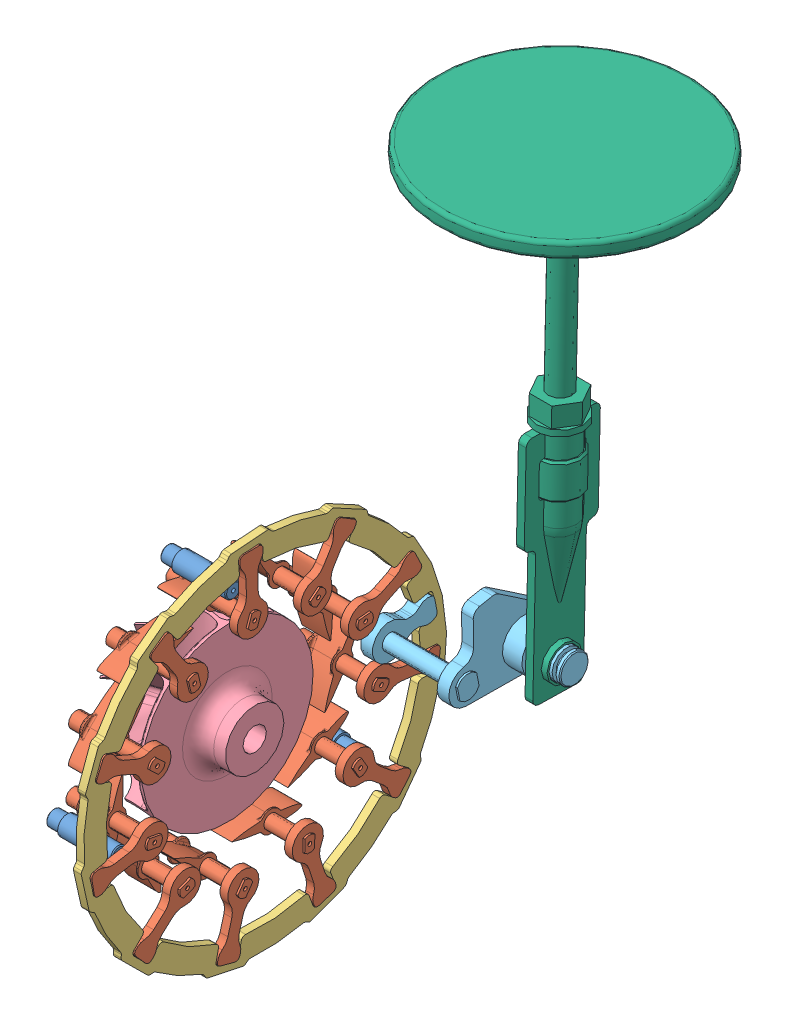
SolidWorks assembly Turbo_Geometrie_Variable.SLDASM, configuration Défaut (file format 3100). Lengths in mm.
Overall size (92.55 179.91 137.02).
35 component instances, 19 part files, 75 mates.
Components (placement in the parent):
- Support_aubes-1: Support_aubes.SLDASM [Défaut] x (-1 0 0) z (0 -0.818224 0.5749) size (38 103.8 103.8)
  - Flasque_2_v2-1: Flasque_2_v2.SLDPRT [Défaut] at origin size (19.5 103.8 103.8)
  - Entretoise-1: Entretoise.SLDPRT [Défaut] at (-2 34.988 -0.9162) size (16.8 5 5)
  - Entretoise-2: Entretoise.SLDPRT [Défaut] at (-2 -22.2199 27.0421) size (16.8 5 5)
  - Entretoise-3: Entretoise.SLDPRT [Défaut] at (-2 -23.6047 -25.8422) size (16.8 5 5)
  - Flasque_1-1: Flasque_1.SLDPRT [Défaut] at (11.3 0 0) x (-1 0 0) z (0 0 -1) size (11.2 83.5 83.5)
- Aube-1: Aube.SLDPRT [Défaut] at (-4 -1.2175 -29.4749) x (0 0.891806 -0.452417) z (-1 0 0) size (18 19.29 20.8)
- Bague_commande-1: Bague_commande.SLDPRT [Défaut] at (5.2 0 0) x (0 -0.976146 -0.217114) z (-1 0 0) size (93.91 94 2)
- Aube-2: Aube.SLDPRT [Défaut] at (-4 -16.9595 -24.1376) x (0 0.50564 -0.862744) z (-1 0 0) size (18 19.29 20.8)
- Aube-3: Aube.SLDPRT [Défaut] at (-4 -27.317 -11.1368) x (0 -0.041063 -0.999157) z (-1 0 0) size (18 19.29 20.8)
- Aube-4: Aube.SLDPRT [Défaut] at (-4 -29.0016 5.3998) x (0 -0.574729 -0.818343) z (-1 0 0) size (18 19.29 20.8)
- Aube-5: Aube.SLDPRT [Défaut] at (-4 -21.4783 20.2221) x (0 -0.925923 -0.377712) z (-1 0 0) size (18 19.29 20.8)
- Aube-6: Aube.SLDPRT [Défaut] at (-4 -7.1359 28.6239) x (0 -0.983143 0.18284) z (-1 0 0) size (18 19.29 20.8)
- Aube-7: Aube.SLDPRT [Défaut] at (-4 9.4722 27.9379) x (0 -0.728221 0.685342) z (-1 0 0) size (18 19.29 20.8)
- Aube-8: Aube.SLDPRT [Défaut] at (-4 26.3055 -13.3518) x (0 0.782003 0.623275) z (-1 0 0) size (18 19.29 20.8)
- Aube-9: Aube.SLDPRT [Défaut] at (-4 23.0729 18.3818) x (0 -0.242095 0.970253) z (-1 0 0) size (18 19.29 20.8)
- Aube-10: Aube.SLDPRT [Défaut] at (-4 29.3481 2.9896) x (0 0.320895 0.947115) z (-1 0 0) size (18 19.29 20.8)
- Aube-11: Aube.SLDPRT [Défaut] at (-4 14.9111 -25.4541) x (0 0.99483 0.10155) z (-1 0 0) size (18 19.29 20.8)
- Turbine-1: Turbine.SLDPRT [Défaut] at (-4 0 0) x (0 0.99715 0.07544) z (0 -0.07544 0.99715) size (44.34 30 44.41)
- Corps-1: Corps.SLDPRT [Défaut] at (-1 0 0) x (-1 0 0) z (0 -0.802817 -0.596225) size (64.1 115 115) (hidden)
- Axe_commande-1: Axe_commande.SLDPRT [Défaut] at (6 7.323 -31.6642) x (0 0.98172 0.190333) z (-1 0 0) size (22.5 27 35.6)
- Butee-1: Butee.SLDPRT [Défaut] at (24 34.6988 -21.5637) x (-1 0 0) z (0 0.802817 0.596225) size (8.08 7 19.5) (hidden)
- Volute_turbine-1: Volute_turbine.SLDPRT [Défaut] at (16.55 0 0) x (1 0 0) z (0 -0.802817 -0.596225) size (116 165.46 146.29) (hidden)
- Platine_poumon-1: Platine_poumon.SLDPRT [Défaut] at (33.55 84.8988 -48.9101) x (0 0 1) z (-1 0 0) size (101.36 60 51) (hidden)
- Prot_therm_poumon-1: Prot_therm_poumon.SLDPRT [Défaut] at (33.55 88.8988 -48.9101) size (80 55 80) (hidden)
- Corps_poumon-1: Corps_poumon.SLDPRT [Défaut] at (33.55 81.8988 -48.9101) size (76 86.5 76) (hidden)
- Piston_Poumon-1: Piston_Poumon.SLDPRT [Défaut] at (33.55 121.1494 -48.9101) x (0 -0.022703 -0.999742) z (1 0 0) size (64 120.5 64)
- Axe-1: Axe.SLDPRT [Défaut] at (-33 0 0) x (-1 0 0) z (0 -0.818224 0.5749) size (122 12 12) (hidden)
- Compresseur-1: Compresseur.SLDPRT [Défaut] at (58.9 0 0) x (0 -1 0) z (0 0 1) size (47.93 29.5 48.01) (hidden)
- Vis-Rondelle_M6-12-1: Vis-Rondelle_M6-12.SLDPRT [Défaut] at (24.25 57.3988 -3.4101) x (0 -1 0) z (0 0 1) size (14 17 14) (hidden)
- Vis-Rondelle_M6-12-2: Vis-Rondelle_M6-12.SLDPRT [Défaut] at (24.25 63.8988 -33.9101) x (0 -1 0) z (0 0 1) size (14 17 14) (hidden)
- Vis-Rondelle_M6-12-3: Vis-Rondelle_M6-12.SLDPRT [Défaut] at (24.25 63.8988 -63.9101) x (0 -1 0) z (0 0 1) size (14 17 14) (hidden)
- Ecrou_M6-1: Ecrou_M6.SLDPRT [Défaut] at (-29.5 0 0) x (0 1 0) z (0 0 1) size (11.55 5 10) (hidden)
- Ecrou-Rondelle_M6-1: Ecrou-Rondelle_M6.SLDPRT [Défaut] at (33.55 81.1988 -30.9101) x (-0.837169 0 -0.546944) z (-0.546944 0 0.837169) size (14 6.2 14) (hidden)
- Ecrou-Rondelle_M6-2: Ecrou-Rondelle_M6.SLDPRT [Défaut] at (33.55 81.1988 -66.9101) x (-0.837169 0 -0.546944) z (-0.546944 0 0.837169) size (14 6.2 14) (hidden)
Mates (geometry in assembly coordinates):
- Coaxiale1: concentric aligned: cylinder of Support_aubes-1/Flasque_2_v2-1; unknown of Aube-1
- Coïncidente1: coincident anti-aligned: plane of Support_aubes-1/Flasque_2_v2-1 through (-4 -24.0308 -34.2018) normal (-1 0 0); unknown of Aube-1
- Coaxiale2: concentric anti-aligned: unknown of Support_aubes-1/Flasque_2_v2-1; unknown of Bague_commande-1
- Coïncidente2: coincident anti-aligned: unknown of Support_aubes-1/Flasque_2_v2-1; unknown of Bague_commande-1
- Tangent1: tangent anti-aligned: unknown of Aube-1; unknown of Bague_commande-1
- Coaxiale3: concentric aligned: unknown of Support_aubes-1/Flasque_2_v2-1; unknown of Aube-2
- Coïncidente3: coincident anti-aligned: unknown of Support_aubes-1/Flasque_2_v2-1; unknown of Aube-2
- Tangent2: tangent anti-aligned: unknown of Bague_commande-1; unknown of Aube-2
- Coaxiale5: concentric aligned: unknown of Support_aubes-1/Flasque_2_v2-1; unknown of Aube-3
- Coïncidente4: coincident anti-aligned: unknown of Support_aubes-1/Flasque_2_v2-1; unknown of Aube-3
- Tangent3: tangent anti-aligned: unknown of Bague_commande-1; unknown of Aube-3
- Coaxiale6: concentric aligned: unknown of Support_aubes-1/Flasque_2_v2-1; unknown of Aube-4
- Tangent4: tangent anti-aligned: unknown of Bague_commande-1; unknown of Aube-4
- Coïncidente6: coincident anti-aligned: unknown of Support_aubes-1/Flasque_2_v2-1; unknown of Aube-4
- Coaxiale7: concentric aligned: unknown of Support_aubes-1/Flasque_2_v2-1; unknown of Aube-5
- Coïncidente7: coincident anti-aligned: unknown of Support_aubes-1/Flasque_2_v2-1; unknown of Aube-5
- Tangent5: tangent anti-aligned: unknown of Bague_commande-1; unknown of Aube-5
- Coaxiale8: concentric aligned: unknown of Support_aubes-1/Flasque_2_v2-1; unknown of Aube-6
- Coïncidente8: coincident anti-aligned: unknown of Support_aubes-1/Flasque_2_v2-1; unknown of Aube-6
- Tangent6: tangent anti-aligned: unknown of Bague_commande-1; unknown of Aube-6
- Coaxiale9: concentric aligned: unknown of Support_aubes-1/Flasque_2_v2-1; unknown of Aube-7
- Coïncidente9: coincident anti-aligned: unknown of Support_aubes-1/Flasque_2_v2-1; unknown of Aube-7
- Tangent7: tangent anti-aligned: unknown of Bague_commande-1; unknown of Aube-7
- Coaxiale10: concentric aligned: unknown of Support_aubes-1/Flasque_2_v2-1; unknown of Aube-9
- Coïncidente10: coincident anti-aligned: unknown of Support_aubes-1/Flasque_2_v2-1; unknown of Aube-9
- Tangent8: tangent anti-aligned: unknown of Bague_commande-1; unknown of Aube-9
- Coaxiale11: concentric aligned: unknown of Support_aubes-1/Flasque_2_v2-1; unknown of Aube-10
- Coïncidente11: coincident anti-aligned: unknown of Support_aubes-1/Flasque_2_v2-1; unknown of Aube-10
- Tangent9: tangent anti-aligned: unknown of Bague_commande-1; unknown of Aube-10
- Coaxiale12: concentric aligned: unknown of Support_aubes-1/Flasque_2_v2-1; unknown of Aube-8
- Coïncidente13: coincident anti-aligned: unknown of Support_aubes-1/Flasque_2_v2-1; unknown of Aube-8
- Tangent11: tangent anti-aligned: unknown of Bague_commande-1; unknown of Aube-8
- Coaxiale13: concentric aligned: unknown of Support_aubes-1/Flasque_2_v2-1; unknown of Aube-11
- Coïncidente14: coincident anti-aligned: unknown of Support_aubes-1/Flasque_2_v2-1; unknown of Aube-11
- Tangent12: tangent anti-aligned: unknown of Bague_commande-1; unknown of Aube-11
- Coaxiale15: concentric aligned: unknown of Support_aubes-1/Flasque_2_v2-1; unknown of Corps-1
- Coaxiale16: concentric aligned: unknown of Support_aubes-1/Flasque_2_v2-1; unknown of Corps-1
- Coïncidente16: coincident anti-aligned: unknown of Support_aubes-1/Flasque_2_v2-1; unknown of Corps-1
- Coaxiale17: concentric anti-aligned: unknown of Corps-1; unknown of Axe_commande-1
- Coïncidente17: coincident anti-aligned: unknown of Corps-1; unknown of Axe_commande-1
- Tangent13: tangent anti-aligned: unknown of Bague_commande-1; unknown of Axe_commande-1
- Coaxiale18: concentric aligned: unknown of Corps-1; unknown of Butee-1
- Coïncidente18: coincident anti-aligned: unknown of Corps-1; unknown of Butee-1
- Coaxiale19: concentric anti-aligned: unknown of Corps-1; unknown of Volute_turbine-1
- Coïncidente19: coincident anti-aligned: unknown of Support_aubes-1/Flasque_2_v2-1; unknown of Volute_turbine-1
- Coïncidente20: coincident anti-aligned: unknown of Volute_turbine-1; unknown of Platine_poumon-1
- Coaxiale20: concentric anti-aligned: unknown of Volute_turbine-1; unknown of Platine_poumon-1
- Coaxiale21: concentric anti-aligned: unknown of Volute_turbine-1; unknown of Platine_poumon-1
- Coïncidente21: coincident anti-aligned: unknown of Platine_poumon-1; unknown of Prot_therm_poumon-1
- Coaxiale22: concentric aligned: unknown of Platine_poumon-1; unknown of Prot_therm_poumon-1
- Coaxiale23: concentric aligned: unknown of Platine_poumon-1; unknown of Prot_therm_poumon-1
- Coïncidente22: coincident anti-aligned: unknown of Prot_therm_poumon-1; unknown of Corps_poumon-1
- Coaxiale24: concentric anti-aligned: circle of Platine_poumon-1 centre (33.55 88.8988 -48.9101) axis (0 1 0); unknown of Corps_poumon-1
- Coaxiale25: concentric anti-aligned: unknown of Platine_poumon-1; unknown of Corps_poumon-1
- Coaxiale26: concentric anti-aligned: unknown of Axe_commande-1; unknown of Piston_Poumon-1
- Tangent14: tangent aligned: unknown of Corps_poumon-1; sphere of Piston_Poumon-1
- Perpendiculaire1: perpendicular: unknown of Corps-1; unknown of Volute_turbine-1
- Coaxiale27: concentric anti-aligned: unknown of Turbine-1; unknown of Axe-1
- Coïncidente23: coincident anti-aligned: unknown of Turbine-1; unknown of Axe-1
- Coïncidente24: coincident anti-aligned: unknown of Corps-1; unknown of Axe-1
- Coaxiale28: concentric aligned: unknown of Corps-1; unknown of Axe-1
- Coaxiale29: concentric anti-aligned: unknown of Axe-1; unknown of Compresseur-1
- Coïncidente25: coincident anti-aligned: unknown of Corps-1; unknown of Compresseur-1
- Coaxiale30: concentric aligned: unknown of Volute_turbine-1; unknown of Vis-Rondelle_M6-12-1
- Coaxiale31: concentric aligned: unknown of Volute_turbine-1; unknown of Vis-Rondelle_M6-12-2
- Coaxiale32: concentric aligned: unknown of Volute_turbine-1; unknown of Vis-Rondelle_M6-12-3
- Coïncidente26: coincident anti-aligned: unknown of Platine_poumon-1; unknown of Vis-Rondelle_M6-12-3
- Coïncidente27: coincident anti-aligned: unknown of Platine_poumon-1; unknown of Vis-Rondelle_M6-12-2
- Coïncidente28: coincident anti-aligned: unknown of Platine_poumon-1; unknown of Vis-Rondelle_M6-12-1
- Coïncidente29: coincident anti-aligned: unknown of Turbine-1; unknown of Ecrou_M6-1
- Coaxiale33: concentric anti-aligned: unknown of Axe-1; unknown of Ecrou_M6-1
- Coïncidente30: coincident anti-aligned: unknown of Platine_poumon-1; unknown of Ecrou-Rondelle_M6-2
- Coïncidente31: coincident anti-aligned: unknown of Platine_poumon-1; unknown of Ecrou-Rondelle_M6-1
- Coaxiale34: concentric anti-aligned: unknown of Corps_poumon-1; unknown of Ecrou-Rondelle_M6-2
- Coaxiale35: concentric anti-aligned: unknown of Corps_poumon-1; unknown of Ecrou-Rondelle_M6-1
